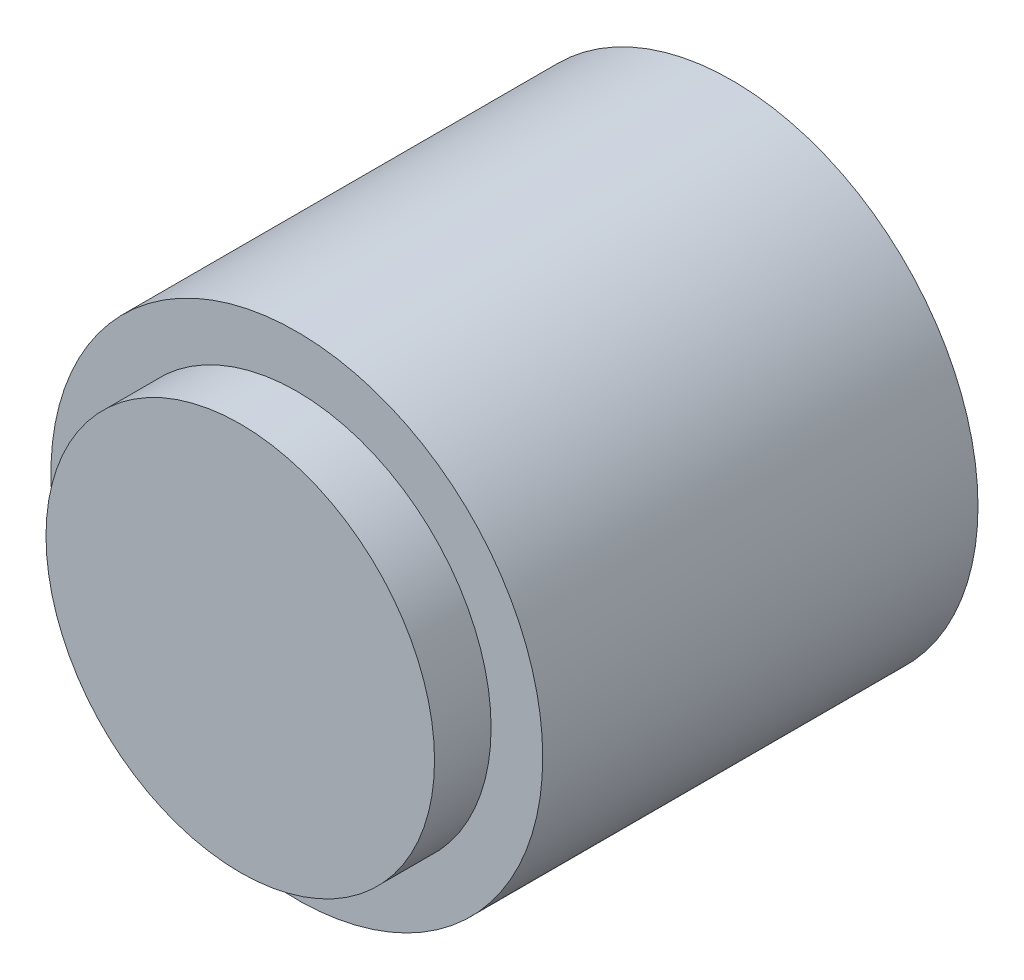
ISO-10303-21;
HEADER;
FILE_DESCRIPTION(('STEP AP214'),'2;1');
FILE_NAME('part.step','',(''),(''),'','','');
FILE_SCHEMA(('AUTOMOTIVE_DESIGN { 1 0 10303 214 1 1 1 1 }'));
ENDSEC;
DATA;
#1=APPLICATION_CONTEXT('core data for automotive mechanical design processes');
#2=APPLICATION_PROTOCOL_DEFINITION('international standard','automotive_design',2000,#1);
#3=PRODUCT_CONTEXT('',#1,'mechanical');
#4=PRODUCT('Part','Part','',(#3));
#5=PRODUCT_RELATED_PRODUCT_CATEGORY('part','',(#4));
#6=PRODUCT_DEFINITION_FORMATION('','',#4);
#7=PRODUCT_DEFINITION_CONTEXT('part definition',#1,'design');
#8=PRODUCT_DEFINITION('design','',#6,#7);
#9=PRODUCT_DEFINITION_SHAPE('','',#8);
#10=(LENGTH_UNIT() NAMED_UNIT(*) SI_UNIT(.MILLI.,.METRE.));
#11=(NAMED_UNIT(*) PLANE_ANGLE_UNIT() SI_UNIT($,.RADIAN.));
#12=(NAMED_UNIT(*) SI_UNIT($,.STERADIAN.) SOLID_ANGLE_UNIT());
#13=UNCERTAINTY_MEASURE_WITH_UNIT(LENGTH_MEASURE(1.E-05),#10,'distance_accuracy_value','');
#14=(GEOMETRIC_REPRESENTATION_CONTEXT(3) GLOBAL_UNCERTAINTY_ASSIGNED_CONTEXT((#13)) GLOBAL_UNIT_ASSIGNED_CONTEXT((#10,
#11,#12)) REPRESENTATION_CONTEXT('',''));
#15=CARTESIAN_POINT('',(0.,0.,0.));
#16=DIRECTION('',(0.,0.,1.));
#17=DIRECTION('',(1.,0.,0.));
#18=AXIS2_PLACEMENT_3D('',#15,#16,#17);
#19=CARTESIAN_POINT('',(0.,0.,30.));
#20=DIRECTION('',(0.,0.,1.));
#21=DIRECTION('',(1.,0.,0.));
#22=AXIS2_PLACEMENT_3D('',#19,#20,#21);
#23=CYLINDRICAL_SURFACE('',#22,5.);
#24=CARTESIAN_POINT('',(0.,0.,0.));
#25=DIRECTION('',(0.,0.,1.));
#26=DIRECTION('',(1.,0.,0.));
#27=AXIS2_PLACEMENT_3D('',#24,#25,#26);
#28=CIRCLE('',#27,5.);
#29=CARTESIAN_POINT('',(5.,0.,0.));
#30=VERTEX_POINT('',#29);
#31=EDGE_CURVE('E8',#30,#30,#28,.T.);
#32=ORIENTED_EDGE('',*,*,#31,.T.);
#33=EDGE_LOOP('',(#32));
#34=FACE_BOUND('',#33,.T.);
#35=CARTESIAN_POINT('',(0.,0.,8.85));
#36=DIRECTION('',(0.,0.,1.));
#37=DIRECTION('',(1.,0.,0.));
#38=AXIS2_PLACEMENT_3D('',#35,#36,#37);
#39=CIRCLE('',#38,5.);
#40=CARTESIAN_POINT('',(5.,0.,8.85));
#41=VERTEX_POINT('',#40);
#42=EDGE_CURVE('E29',#41,#41,#39,.T.);
#43=ORIENTED_EDGE('',*,*,#42,.F.);
#44=EDGE_LOOP('',(#43));
#45=FACE_BOUND('',#44,.T.);
#46=ADVANCED_FACE('F13',(#34,#45),#23,.T.);
#47=CARTESIAN_POINT('',(2.5,0.,0.));
#48=DIRECTION('',(0.,0.,1.));
#49=DIRECTION('',(1.,0.,0.));
#50=AXIS2_PLACEMENT_3D('',#47,#48,#49);
#51=PLANE('',#50);
#52=ORIENTED_EDGE('',*,*,#31,.F.);
#53=EDGE_LOOP('',(#52));
#54=FACE_BOUND('',#53,.T.);
#55=CARTESIAN_POINT('',(0.,0.,0.));
#56=DIRECTION('',(0.,0.,1.));
#57=DIRECTION('',(1.,0.,0.));
#58=AXIS2_PLACEMENT_3D('',#55,#56,#57);
#59=CIRCLE('',#58,2.5);
#60=CARTESIAN_POINT('',(2.5,0.,0.));
#61=VERTEX_POINT('',#60);
#62=EDGE_CURVE('E20',#61,#61,#59,.T.);
#63=ORIENTED_EDGE('',*,*,#62,.T.);
#64=EDGE_LOOP('',(#63));
#65=FACE_BOUND('',#64,.T.);
#66=ADVANCED_FACE('F42',(#54,#65),#51,.F.);
#67=CARTESIAN_POINT('',(0.,0.,30.));
#68=DIRECTION('',(0.,0.,1.));
#69=DIRECTION('',(1.,0.,0.));
#70=AXIS2_PLACEMENT_3D('',#67,#68,#69);
#71=CYLINDRICAL_SURFACE('',#70,2.5);
#72=CARTESIAN_POINT('',(0.,0.,6.));
#73=DIRECTION('',(0.,0.,-1.));
#74=DIRECTION('',(-1.,0.,0.));
#75=AXIS2_PLACEMENT_3D('',#72,#73,#74);
#76=CIRCLE('',#75,2.5);
#77=CARTESIAN_POINT('',(-2.5,0.,6.));
#78=VERTEX_POINT('',#77);
#79=EDGE_CURVE('E32',#78,#78,#76,.T.);
#80=ORIENTED_EDGE('',*,*,#79,.F.);
#81=EDGE_LOOP('',(#80));
#82=FACE_BOUND('',#81,.T.);
#83=ORIENTED_EDGE('',*,*,#62,.F.);
#84=EDGE_LOOP('',(#83));
#85=FACE_BOUND('',#84,.T.);
#86=ADVANCED_FACE('F38',(#82,#85),#71,.F.);
#87=CARTESIAN_POINT('',(0.,0.,20.));
#88=DIRECTION('',(0.,0.,1.));
#89=DIRECTION('',(1.,0.,0.));
#90=AXIS2_PLACEMENT_3D('',#87,#88,#89);
#91=CYLINDRICAL_SURFACE('',#90,3.95);
#92=CARTESIAN_POINT('',(0.,0.,8.85));
#93=DIRECTION('',(0.,0.,1.));
#94=DIRECTION('',(1.,0.,0.));
#95=AXIS2_PLACEMENT_3D('',#92,#93,#94);
#96=CIRCLE('',#95,3.95);
#97=CARTESIAN_POINT('',(3.95,0.,8.85));
#98=VERTEX_POINT('',#97);
#99=EDGE_CURVE('E26',#98,#98,#96,.T.);
#100=ORIENTED_EDGE('',*,*,#99,.T.);
#101=EDGE_LOOP('',(#100));
#102=FACE_BOUND('',#101,.T.);
#103=CARTESIAN_POINT('',(0.,0.,10.));
#104=DIRECTION('',(0.,0.,-1.));
#105=DIRECTION('',(-1.,0.,0.));
#106=AXIS2_PLACEMENT_3D('',#103,#104,#105);
#107=CIRCLE('',#106,3.95);
#108=CARTESIAN_POINT('',(-3.95,0.,10.));
#109=VERTEX_POINT('',#108);
#110=EDGE_CURVE('E16',#109,#109,#107,.T.);
#111=ORIENTED_EDGE('',*,*,#110,.T.);
#112=EDGE_LOOP('',(#111));
#113=FACE_BOUND('',#112,.T.);
#114=ADVANCED_FACE('F41',(#102,#113),#91,.T.);
#115=CARTESIAN_POINT('',(-3.95,0.,8.85));
#116=DIRECTION('',(0.,0.,1.));
#117=DIRECTION('',(1.,0.,0.));
#118=AXIS2_PLACEMENT_3D('',#115,#116,#117);
#119=PLANE('',#118);
#120=ORIENTED_EDGE('',*,*,#42,.T.);
#121=EDGE_LOOP('',(#120));
#122=FACE_BOUND('',#121,.T.);
#123=ORIENTED_EDGE('',*,*,#99,.F.);
#124=EDGE_LOOP('',(#123));
#125=FACE_BOUND('',#124,.T.);
#126=ADVANCED_FACE('F57',(#122,#125),#119,.T.);
#127=CARTESIAN_POINT('',(5.,0.,10.));
#128=DIRECTION('',(0.,0.,-1.));
#129=DIRECTION('',(-1.,0.,0.));
#130=AXIS2_PLACEMENT_3D('',#127,#128,#129);
#131=PLANE('',#130);
#132=ORIENTED_EDGE('',*,*,#110,.F.);
#133=EDGE_LOOP('',(#132));
#134=FACE_BOUND('',#133,.T.);
#135=ADVANCED_FACE('F54',(#134),#131,.F.);
#136=CARTESIAN_POINT('',(0.,0.,6.));
#137=DIRECTION('',(0.,0.,-1.));
#138=DIRECTION('',(-1.,0.,0.));
#139=AXIS2_PLACEMENT_3D('',#136,#137,#138);
#140=PLANE('',#139);
#141=ORIENTED_EDGE('',*,*,#79,.T.);
#142=EDGE_LOOP('',(#141));
#143=FACE_BOUND('',#142,.T.);
#144=ADVANCED_FACE('F36',(#143),#140,.T.);
#145=CLOSED_SHELL('',(#46,#66,#86,#114,#126,#135,#144));
#146=MANIFOLD_SOLID_BREP('B1',#145);
#147=ADVANCED_BREP_SHAPE_REPRESENTATION('',(#18,#146),#14);
#148=SHAPE_DEFINITION_REPRESENTATION(#9,#147);
ENDSEC;
END-ISO-10303-21;
